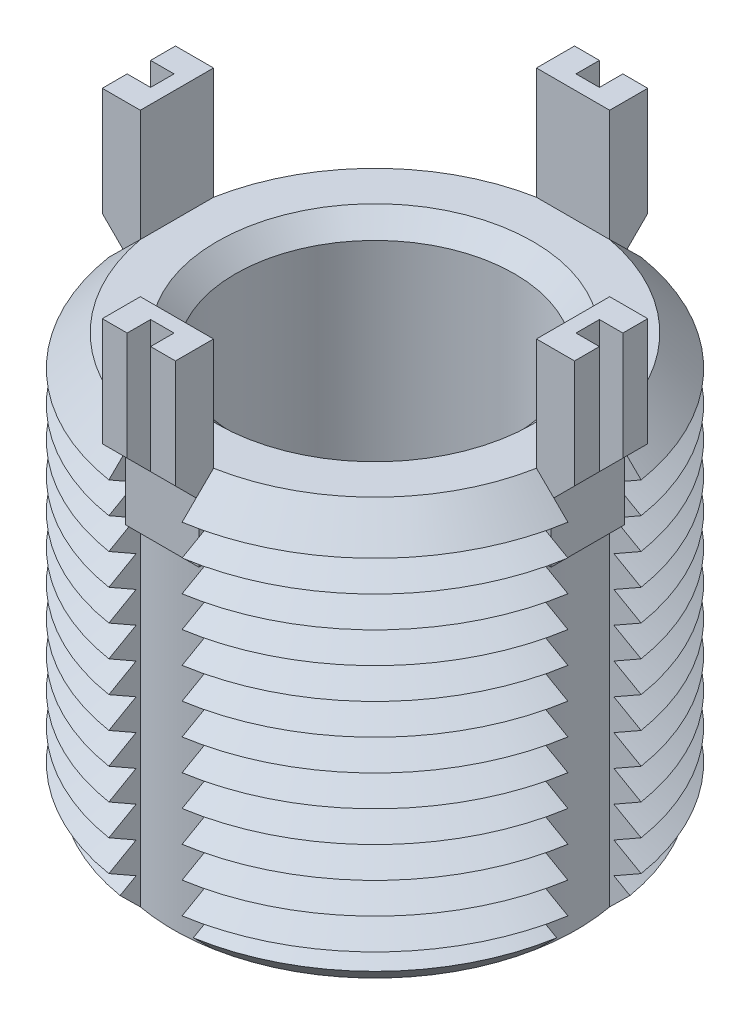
from build123d import *

# Parameters (mm, degrees)
SKETCH1_R               = 15.875
BOSS_EXTRUDE1_DEPTH     = 28.448
CHAMFER1_SIZE           = 2.117
LPATTERN1_COUNT         = 12
LPATTERN1_PITCH         = 2.117
CUT_EXTRUDE1_REACH      = 38.24
CIRPATTERN1_COUNT       = 4
BOSS_EXTRUDE3_DEPTH     = 2.5
CIRPATTERN2_COUNT       = 4
CUT_EXTRUDE3_DEPTH      = 43.699878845
CUT_EXTRUDE3_DEPTH_BACK = 43.699878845
SKETCH6_W               = 1.6
SKETCH6_H               = 1.6
SKETCH7_R               = 9.525
CUT_EXTRUDE4_DEPTH      = 28.448
CHAMFER2_SIZE           = 1.27


with BuildPart() as part:
    # Sketch1 → Boss-Extrude1 (new body)
    with BuildSketch(Plane(origin=(0, 0, 0), x_dir=(1, 0, 0), z_dir=(0, 1, 0))):
        with Locations(Location((0, 0, 0), (0, 0, 270))):
            Circle(SKETCH1_R)
    extrude(amount=-BOSS_EXTRUDE1_DEPTH)

    # Chamfer1
    chamfer1_edges = [part.edges().sort_by_distance(p)[0] for p in [
        (0, 0, -15.875),
        (0, -28.448, -15.875),
    ]]
    chamfer(chamfer1_edges, length=CHAMFER1_SIZE)

    # Sketch3 → Cut-Revolve1 (revolve, cut)
    with BuildSketch(Plane(origin=(0, 0, 0), x_dir=(0, 0, -1), z_dir=(1, 0, 0))):
        Polygon((-15.875, -2.117), (-14.04162422, -3.1755), (-15.875, -4.234), align=None)
    cut_revolve1 = revolve(axis=Axis((0, 0.885892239, 0), (0, -1, 0)), mode=Mode.SUBTRACT)

    # LPattern1: Cut-Revolve1 ×12
    with Locations(*[(0, -i * LPATTERN1_PITCH, 0) for i in range(1, LPATTERN1_COUNT)]):
        add(cut_revolve1, mode=Mode.SUBTRACT)

    # Cut-Extrude1: up to this cone (the profile starts inside it)
    cut_extrude1_end = Plane(origin=(0, 0, 0), z_dir=(0, 1, 0)).offset(-42.205999) * Cone(1e-06, 123.152, 123.151999, align=(Align.CENTER, Align.CENTER, Align.MIN), mode=Mode.PRIVATE)
    # Sketch4 → Cut-Extrude1 (cut, up to the surface)
    with BuildSketch(Plane(origin=(0, 0, 0), x_dir=(1, 0, 0), z_dir=(0, 1, 0)), mode=Mode.PRIVATE) as cut_extrude1_sk1:
        with BuildLine():
            Line((-13.528952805, 2.5), (-15.676913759, 2.5))
            ThreePointArc((-15.676913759, 2.5), (-15.875, 0), (-15.676913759, -2.5))
            Line((-15.676913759, -2.5), (-13.528952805, -2.5))
            ThreePointArc((-13.528952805, -2.5), (-13.758, 0), (-13.528952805, 2.5))
        make_face()
    cut_extrude1_tool1 = extrude(cut_extrude1_sk1.sketch, amount=-CUT_EXTRUDE1_REACH, mode=Mode.PRIVATE) & cut_extrude1_end
    cut_extrude1 = cut_extrude1_tool1.solids().sort_by_distance((-14.745247, 0, 0))[0]
    add(cut_extrude1, mode=Mode.SUBTRACT)

    # CirPattern1: Cut-Extrude1 ×4 about axis
    cirpattern1_axis = Axis((0, 0, 0), (0, 1, 0))
    for i in range(1, CIRPATTERN1_COUNT):
        add(cut_extrude1.rotate(cirpattern1_axis, i * 360 / CIRPATTERN1_COUNT), mode=Mode.SUBTRACT)

    # Sketch5 → Boss-Extrude3 (add, symmetric)
    with BuildSketch(Plane(origin=(0, 0, 0), x_dir=(0, 0, -1), z_dir=(1, 0, 0))):
        Polygon((-13.528952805, 7.649), (-13.528952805, -5.351), (-14.528952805, -5.351), (-14.528952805, -1.351), (-16.128952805, 0.249), (-16.128952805, 7.649), align=None)
    boss_extrude3 = extrude(amount=BOSS_EXTRUDE3_DEPTH, both=True)

    # CirPattern2: Boss-Extrude3 ×4 about axis
    cirpattern2_axis = Axis((0, 0, 0), (0, 1, 0))
    for i in range(1, CIRPATTERN2_COUNT):
        add(boss_extrude3.rotate(cirpattern2_axis, i * 360 / CIRPATTERN2_COUNT))

    # Sketch6 → Cut-Extrude3 (cut, two sides: drawn at the far end of the back side and taken through both)
    with BuildSketch(Plane(origin=(0, 7.649, 0), x_dir=(1, 0, 0), z_dir=(0, 1, 0)).offset(-CUT_EXTRUDE3_DEPTH_BACK)):
        with Locations((-15.328952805, 0)):
            Rectangle(SKETCH6_W, SKETCH6_H)
        with Locations((0, 15.328952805)):
            Rectangle(SKETCH6_W, SKETCH6_H)
        with Locations((15.328952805, 0)):
            Rectangle(SKETCH6_W, SKETCH6_H)
        with Locations((0, -15.328952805)):
            Rectangle(SKETCH6_W, SKETCH6_H)
    extrude(amount=CUT_EXTRUDE3_DEPTH + CUT_EXTRUDE3_DEPTH_BACK, mode=Mode.SUBTRACT)

    # Sketch7 → Cut-Extrude4 (cut)
    with BuildSketch(Plane(origin=(0, 0, 0), x_dir=(1, 0, 0), z_dir=(0, 1, 0))):
        with Locations(Location((0, 0, 0), (0, 0, 270))):
            Circle(SKETCH7_R)
    extrude(amount=-CUT_EXTRUDE4_DEPTH, mode=Mode.SUBTRACT)

    # Chamfer2
    chamfer2_edges = [part.edges().sort_by_distance(p)[0] for p in [
        (0, 0, -9.525),
        (0, -28.448, -9.525),
    ]]
    chamfer(chamfer2_edges, length=CHAMFER2_SIZE)


solid = part.part
